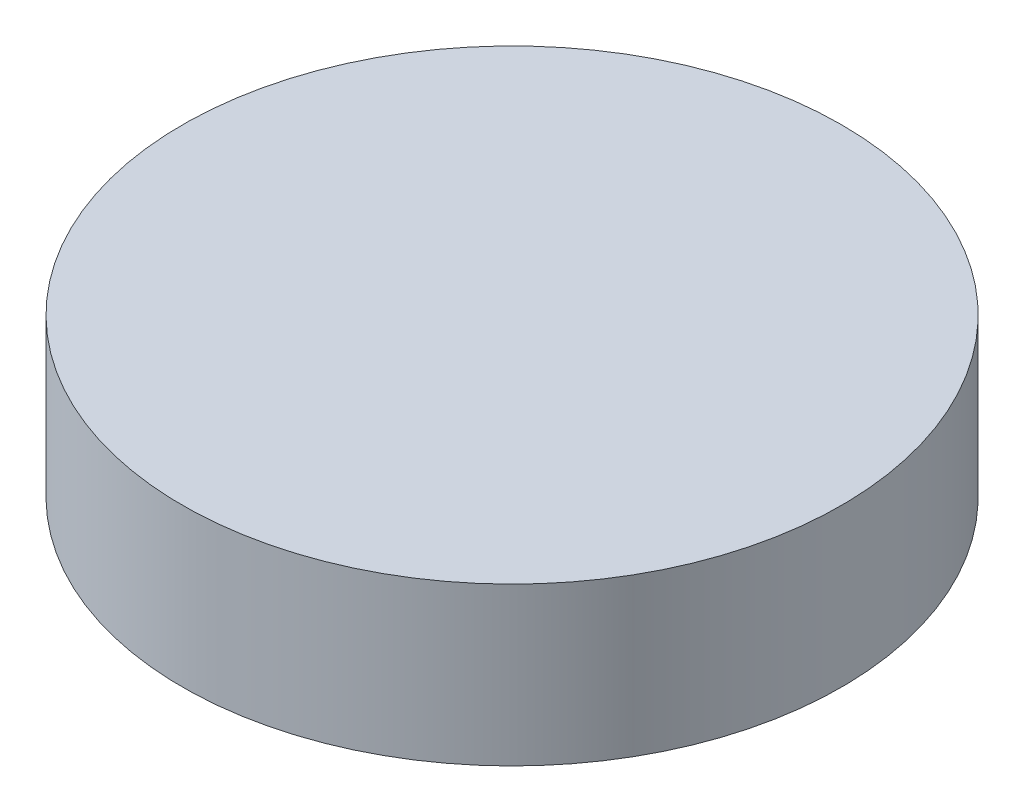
from build123d import *


with BuildPart() as part:
    # Sketch 1 → Revolve 1 (revolve)
    with BuildSketch(Plane.XY, mode=Mode.PRIVATE) as revolve_1_sk:
        Polygon((0, 380), (565, 380), (565, 110), (360, 0), (0, 0), align=None)
    revolve(revolve_1_sk.sketch.rotate(Axis((0, 0, 0), (0, 1, 0)), 90), axis=Axis((0, 0, 0), (0, 1, 0)))


solid = part.part
